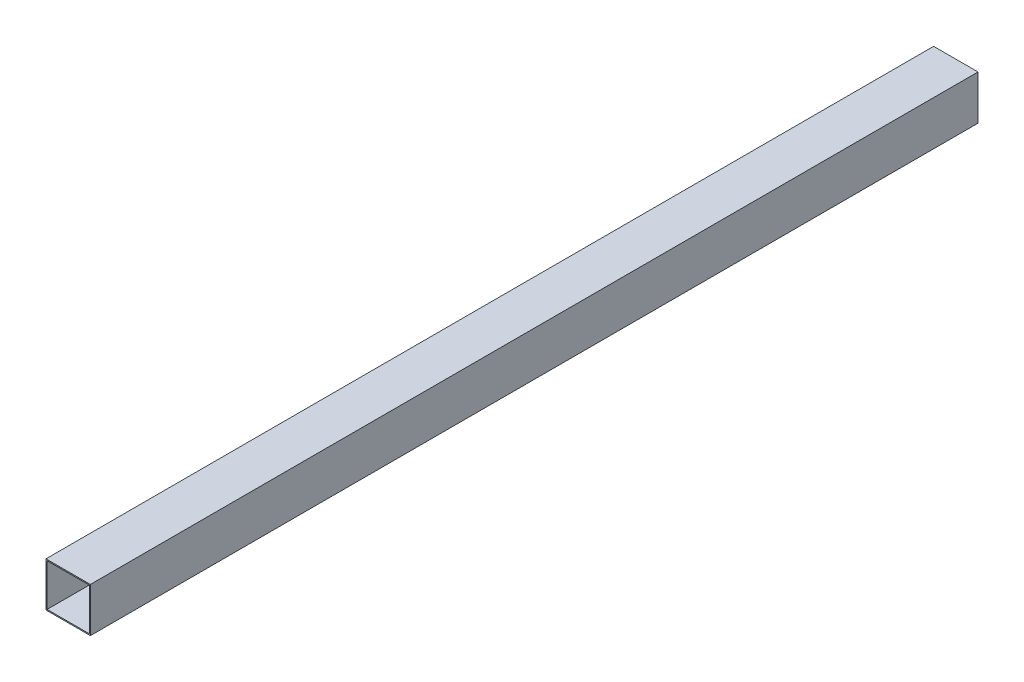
from build123d import *

# Parameters (mm, degrees)
SCHIZZO1_W                = 40
SCHIZZO1_H                = 40
SCHIZZO1_W_2              = 38
SCHIZZO1_H_2              = 38
ESTRUSIONE_SOTTILE1_DEPTH = 800


with BuildPart() as part:
    # Schizzo1 → Estrusione-Sottile1 (new body)
    with BuildSketch(Plane.XY):
        Rectangle(SCHIZZO1_W, SCHIZZO1_H)
        Rectangle(SCHIZZO1_W_2, SCHIZZO1_H_2, mode=Mode.SUBTRACT)
    extrude(amount=ESTRUSIONE_SOTTILE1_DEPTH)


solid = part.part
